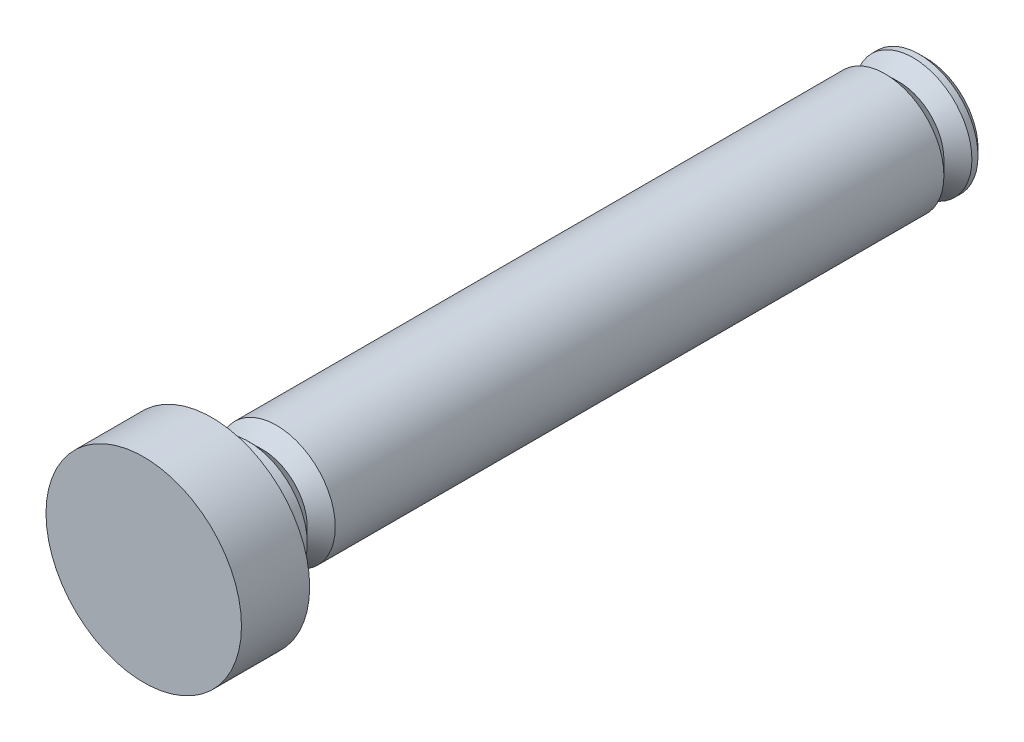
ISO-10303-21;
HEADER;
FILE_DESCRIPTION(('STEP AP214'),'2;1');
FILE_NAME('part.step','',(''),(''),'','','');
FILE_SCHEMA(('AUTOMOTIVE_DESIGN { 1 0 10303 214 1 1 1 1 }'));
ENDSEC;
DATA;
#1=APPLICATION_CONTEXT('core data for automotive mechanical design processes');
#2=APPLICATION_PROTOCOL_DEFINITION('international standard','automotive_design',2000,#1);
#3=PRODUCT_CONTEXT('',#1,'mechanical');
#4=PRODUCT('Part','Part','',(#3));
#5=PRODUCT_RELATED_PRODUCT_CATEGORY('part','',(#4));
#6=PRODUCT_DEFINITION_FORMATION('','',#4);
#7=PRODUCT_DEFINITION_CONTEXT('part definition',#1,'design');
#8=PRODUCT_DEFINITION('design','',#6,#7);
#9=PRODUCT_DEFINITION_SHAPE('','',#8);
#10=(LENGTH_UNIT() NAMED_UNIT(*) SI_UNIT(.MILLI.,.METRE.));
#11=(NAMED_UNIT(*) PLANE_ANGLE_UNIT() SI_UNIT($,.RADIAN.));
#12=(NAMED_UNIT(*) SI_UNIT($,.STERADIAN.) SOLID_ANGLE_UNIT());
#13=UNCERTAINTY_MEASURE_WITH_UNIT(LENGTH_MEASURE(1.E-05),#10,'distance_accuracy_value','');
#14=(GEOMETRIC_REPRESENTATION_CONTEXT(3) GLOBAL_UNCERTAINTY_ASSIGNED_CONTEXT((#13)) GLOBAL_UNIT_ASSIGNED_CONTEXT((#10,
#11,#12)) REPRESENTATION_CONTEXT('',''));
#15=CARTESIAN_POINT('',(0.,0.,0.));
#16=DIRECTION('',(0.,0.,1.));
#17=DIRECTION('',(1.,0.,0.));
#18=AXIS2_PLACEMENT_3D('',#15,#16,#17);
#19=CARTESIAN_POINT('',(0.,0.,0.));
#20=DIRECTION('',(0.,0.,-1.));
#21=DIRECTION('',(-1.,0.,0.));
#22=AXIS2_PLACEMENT_3D('',#19,#20,#21);
#23=PLANE('',#22);
#24=CARTESIAN_POINT('',(0.,0.,0.));
#25=DIRECTION('',(0.,0.,1.));
#26=DIRECTION('',(1.,0.,0.));
#27=AXIS2_PLACEMENT_3D('',#24,#25,#26);
#28=CIRCLE('',#27,4.0767);
#29=CARTESIAN_POINT('',(4.0767,0.,0.));
#30=VERTEX_POINT('',#29);
#31=EDGE_CURVE('E10',#30,#30,#28,.T.);
#32=ORIENTED_EDGE('',*,*,#31,.T.);
#33=EDGE_LOOP('',(#32));
#34=FACE_BOUND('',#33,.T.);
#35=ADVANCED_FACE('F30',(#34),#23,.F.);
#36=CARTESIAN_POINT('',(0.,0.,0.));
#37=DIRECTION('',(0.,0.,1.));
#38=DIRECTION('',(1.,0.,0.));
#39=AXIS2_PLACEMENT_3D('',#36,#37,#38);
#40=CYLINDRICAL_SURFACE('',#39,4.0767);
#41=ORIENTED_EDGE('',*,*,#31,.F.);
#42=EDGE_LOOP('',(#41));
#43=FACE_BOUND('',#42,.T.);
#44=CARTESIAN_POINT('',(0.,0.,-2.8448));
#45=DIRECTION('',(0.,0.,1.));
#46=DIRECTION('',(1.,0.,0.));
#47=AXIS2_PLACEMENT_3D('',#44,#45,#46);
#48=CIRCLE('',#47,4.0767);
#49=CARTESIAN_POINT('',(4.0767,0.,-2.8448));
#50=VERTEX_POINT('',#49);
#51=EDGE_CURVE('E36',#50,#50,#48,.T.);
#52=ORIENTED_EDGE('',*,*,#51,.T.);
#53=EDGE_LOOP('',(#52));
#54=FACE_BOUND('',#53,.T.);
#55=ADVANCED_FACE('F83',(#43,#54),#40,.T.);
#56=CARTESIAN_POINT('',(0.,4.0767,-2.8448));
#57=DIRECTION('',(0.,0.,1.));
#58=DIRECTION('',(1.,0.,0.));
#59=AXIS2_PLACEMENT_3D('',#56,#57,#58);
#60=PLANE('',#59);
#61=ORIENTED_EDGE('',*,*,#51,.F.);
#62=EDGE_LOOP('',(#61));
#63=FACE_BOUND('',#62,.T.);
#64=CARTESIAN_POINT('',(0.,0.,-2.8448));
#65=DIRECTION('',(0.,0.,1.));
#66=DIRECTION('',(1.,0.,0.));
#67=AXIS2_PLACEMENT_3D('',#64,#65,#66);
#68=CIRCLE('',#67,2.4511);
#69=CARTESIAN_POINT('',(2.4511,0.,-2.8448));
#70=VERTEX_POINT('',#69);
#71=EDGE_CURVE('E40',#70,#70,#68,.T.);
#72=ORIENTED_EDGE('',*,*,#71,.T.);
#73=EDGE_LOOP('',(#72));
#74=FACE_BOUND('',#73,.T.);
#75=ADVANCED_FACE('F87',(#63,#74),#60,.F.);
#76=CARTESIAN_POINT('',(0.,0.,0.));
#77=DIRECTION('',(0.,0.,1.));
#78=DIRECTION('',(1.,0.,0.));
#79=AXIS2_PLACEMENT_3D('',#76,#77,#78);
#80=CYLINDRICAL_SURFACE('',#79,2.4511);
#81=ORIENTED_EDGE('',*,*,#71,.F.);
#82=EDGE_LOOP('',(#81));
#83=FACE_BOUND('',#82,.T.);
#84=CARTESIAN_POINT('',(0.,0.,-4.3688));
#85=DIRECTION('',(0.,0.,1.));
#86=DIRECTION('',(1.,0.,0.));
#87=AXIS2_PLACEMENT_3D('',#84,#85,#86);
#88=CIRCLE('',#87,2.4511);
#89=CARTESIAN_POINT('',(2.4511,0.,-4.3688));
#90=VERTEX_POINT('',#89);
#91=EDGE_CURVE('E44',#90,#90,#88,.T.);
#92=ORIENTED_EDGE('',*,*,#91,.T.);
#93=EDGE_LOOP('',(#92));
#94=FACE_BOUND('',#93,.T.);
#95=ADVANCED_FACE('F92',(#83,#94),#80,.T.);
#96=CARTESIAN_POINT('',(0.,0.,-4.95300000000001));
#97=DIRECTION('',(0.,0.,1.));
#98=DIRECTION('',(1.,0.,0.));
#99=AXIS2_PLACEMENT_3D('',#96,#97,#98);
#100=CONICAL_SURFACE('',#99,1.8669,0.785398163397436);
#101=ORIENTED_EDGE('',*,*,#91,.F.);
#102=EDGE_LOOP('',(#101));
#103=FACE_BOUND('',#102,.T.);
#104=CARTESIAN_POINT('',(0.,0.,-4.95300000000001));
#105=DIRECTION('',(0.,0.,1.));
#106=DIRECTION('',(1.,0.,0.));
#107=AXIS2_PLACEMENT_3D('',#104,#105,#106);
#108=CIRCLE('',#107,1.8669);
#109=CARTESIAN_POINT('',(1.8669,0.,-4.95300000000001));
#110=VERTEX_POINT('',#109);
#111=EDGE_CURVE('E49',#110,#110,#108,.T.);
#112=ORIENTED_EDGE('',*,*,#111,.T.);
#113=EDGE_LOOP('',(#112));
#114=FACE_BOUND('',#113,.T.);
#115=ADVANCED_FACE('F98',(#103,#114),#100,.T.);
#116=CARTESIAN_POINT('',(0.,0.,-5.53720000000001));
#117=DIRECTION('',(0.,0.,-1.));
#118=DIRECTION('',(-1.,0.,0.));
#119=AXIS2_PLACEMENT_3D('',#116,#117,#118);
#120=CONICAL_SURFACE('',#119,2.45110000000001,0.78539816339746);
#121=ORIENTED_EDGE('',*,*,#111,.F.);
#122=EDGE_LOOP('',(#121));
#123=FACE_BOUND('',#122,.T.);
#124=CARTESIAN_POINT('',(0.,0.,-5.53720000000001));
#125=DIRECTION('',(0.,0.,1.));
#126=DIRECTION('',(1.,0.,0.));
#127=AXIS2_PLACEMENT_3D('',#124,#125,#126);
#128=CIRCLE('',#127,2.45110000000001);
#129=CARTESIAN_POINT('',(2.45110000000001,0.,-5.53720000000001));
#130=VERTEX_POINT('',#129);
#131=EDGE_CURVE('E52',#130,#130,#128,.T.);
#132=ORIENTED_EDGE('',*,*,#131,.T.);
#133=EDGE_LOOP('',(#132));
#134=FACE_BOUND('',#133,.T.);
#135=ADVANCED_FACE('F102',(#123,#134),#120,.T.);
#136=CARTESIAN_POINT('',(0.,0.,0.));
#137=DIRECTION('',(0.,0.,1.));
#138=DIRECTION('',(1.,0.,0.));
#139=AXIS2_PLACEMENT_3D('',#136,#137,#138);
#140=CYLINDRICAL_SURFACE('',#139,2.45110000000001);
#141=ORIENTED_EDGE('',*,*,#131,.F.);
#142=EDGE_LOOP('',(#141));
#143=FACE_BOUND('',#142,.T.);
#144=CARTESIAN_POINT('',(0.,0.,-30.9245));
#145=DIRECTION('',(0.,0.,1.));
#146=DIRECTION('',(1.,0.,0.));
#147=AXIS2_PLACEMENT_3D('',#144,#145,#146);
#148=CIRCLE('',#147,2.45110000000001);
#149=CARTESIAN_POINT('',(2.45110000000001,0.,-30.9245));
#150=VERTEX_POINT('',#149);
#151=EDGE_CURVE('E55',#150,#150,#148,.T.);
#152=ORIENTED_EDGE('',*,*,#151,.T.);
#153=EDGE_LOOP('',(#152));
#154=FACE_BOUND('',#153,.T.);
#155=ADVANCED_FACE('F106',(#143,#154),#140,.T.);
#156=CARTESIAN_POINT('',(0.,0.,-31.5087));
#157=DIRECTION('',(0.,0.,1.));
#158=DIRECTION('',(1.,0.,0.));
#159=AXIS2_PLACEMENT_3D('',#156,#157,#158);
#160=CONICAL_SURFACE('',#159,1.8669,0.785398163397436);
#161=ORIENTED_EDGE('',*,*,#151,.F.);
#162=EDGE_LOOP('',(#161));
#163=FACE_BOUND('',#162,.T.);
#164=CARTESIAN_POINT('',(0.,0.,-31.5087));
#165=DIRECTION('',(0.,0.,1.));
#166=DIRECTION('',(1.,0.,0.));
#167=AXIS2_PLACEMENT_3D('',#164,#165,#166);
#168=CIRCLE('',#167,1.8669);
#169=CARTESIAN_POINT('',(1.8669,0.,-31.5087));
#170=VERTEX_POINT('',#169);
#171=EDGE_CURVE('E58',#170,#170,#168,.T.);
#172=ORIENTED_EDGE('',*,*,#171,.T.);
#173=EDGE_LOOP('',(#172));
#174=FACE_BOUND('',#173,.T.);
#175=ADVANCED_FACE('F110',(#163,#174),#160,.T.);
#176=CARTESIAN_POINT('',(0.,0.,-32.0929));
#177=DIRECTION('',(0.,0.,-1.));
#178=DIRECTION('',(-1.,0.,0.));
#179=AXIS2_PLACEMENT_3D('',#176,#177,#178);
#180=CONICAL_SURFACE('',#179,2.45110000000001,0.785398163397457);
#181=ORIENTED_EDGE('',*,*,#171,.F.);
#182=EDGE_LOOP('',(#181));
#183=FACE_BOUND('',#182,.T.);
#184=CARTESIAN_POINT('',(0.,0.,-32.0929));
#185=DIRECTION('',(0.,0.,1.));
#186=DIRECTION('',(1.,0.,0.));
#187=AXIS2_PLACEMENT_3D('',#184,#185,#186);
#188=CIRCLE('',#187,2.45110000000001);
#189=CARTESIAN_POINT('',(2.45110000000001,0.,-32.0929));
#190=VERTEX_POINT('',#189);
#191=EDGE_CURVE('E61',#190,#190,#188,.T.);
#192=ORIENTED_EDGE('',*,*,#191,.T.);
#193=EDGE_LOOP('',(#192));
#194=FACE_BOUND('',#193,.T.);
#195=ADVANCED_FACE('F114',(#183,#194),#180,.T.);
#196=CARTESIAN_POINT('',(0.,0.,0.));
#197=DIRECTION('',(0.,0.,1.));
#198=DIRECTION('',(1.,0.,0.));
#199=AXIS2_PLACEMENT_3D('',#196,#197,#198);
#200=CYLINDRICAL_SURFACE('',#199,2.45110000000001);
#201=ORIENTED_EDGE('',*,*,#191,.F.);
#202=EDGE_LOOP('',(#201));
#203=FACE_BOUND('',#202,.T.);
#204=CARTESIAN_POINT('',(0.,0.,-32.3469));
#205=DIRECTION('',(0.,0.,1.));
#206=DIRECTION('',(1.,0.,0.));
#207=AXIS2_PLACEMENT_3D('',#204,#205,#206);
#208=CIRCLE('',#207,2.45110000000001);
#209=CARTESIAN_POINT('',(2.45110000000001,0.,-32.3469));
#210=VERTEX_POINT('',#209);
#211=EDGE_CURVE('E64',#210,#210,#208,.T.);
#212=ORIENTED_EDGE('',*,*,#211,.T.);
#213=EDGE_LOOP('',(#212));
#214=FACE_BOUND('',#213,.T.);
#215=ADVANCED_FACE('F79',(#203,#214),#200,.T.);
#216=CARTESIAN_POINT('',(0.,0.,-32.639));
#217=DIRECTION('',(0.,0.,1.));
#218=DIRECTION('',(1.,0.,0.));
#219=AXIS2_PLACEMENT_3D('',#216,#217,#218);
#220=CONICAL_SURFACE('',#219,2.159,0.785398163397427);
#221=ORIENTED_EDGE('',*,*,#211,.F.);
#222=EDGE_LOOP('',(#221));
#223=FACE_BOUND('',#222,.T.);
#224=CARTESIAN_POINT('',(0.,0.,-32.639));
#225=DIRECTION('',(0.,0.,1.));
#226=DIRECTION('',(1.,0.,0.));
#227=AXIS2_PLACEMENT_3D('',#224,#225,#226);
#228=CIRCLE('',#227,2.159);
#229=CARTESIAN_POINT('',(2.159,0.,-32.639));
#230=VERTEX_POINT('',#229);
#231=EDGE_CURVE('E67',#230,#230,#228,.T.);
#232=ORIENTED_EDGE('',*,*,#231,.T.);
#233=EDGE_LOOP('',(#232));
#234=FACE_BOUND('',#233,.T.);
#235=ADVANCED_FACE('F71',(#223,#234),#220,.T.);
#236=CARTESIAN_POINT('',(0.,2.159,-32.639));
#237=DIRECTION('',(0.,0.,1.));
#238=DIRECTION('',(1.,0.,0.));
#239=AXIS2_PLACEMENT_3D('',#236,#237,#238);
#240=PLANE('',#239);
#241=ORIENTED_EDGE('',*,*,#231,.F.);
#242=EDGE_LOOP('',(#241));
#243=FACE_BOUND('',#242,.T.);
#244=ADVANCED_FACE('F73',(#243),#240,.F.);
#245=CLOSED_SHELL('',(#35,#55,#75,#95,#115,#135,#155,#175,#195,#215,#235,#244));
#246=MANIFOLD_SOLID_BREP('B2',#245);
#247=ADVANCED_BREP_SHAPE_REPRESENTATION('',(#18,#246),#14);
#248=SHAPE_DEFINITION_REPRESENTATION(#9,#247);
ENDSEC;
END-ISO-10303-21;
